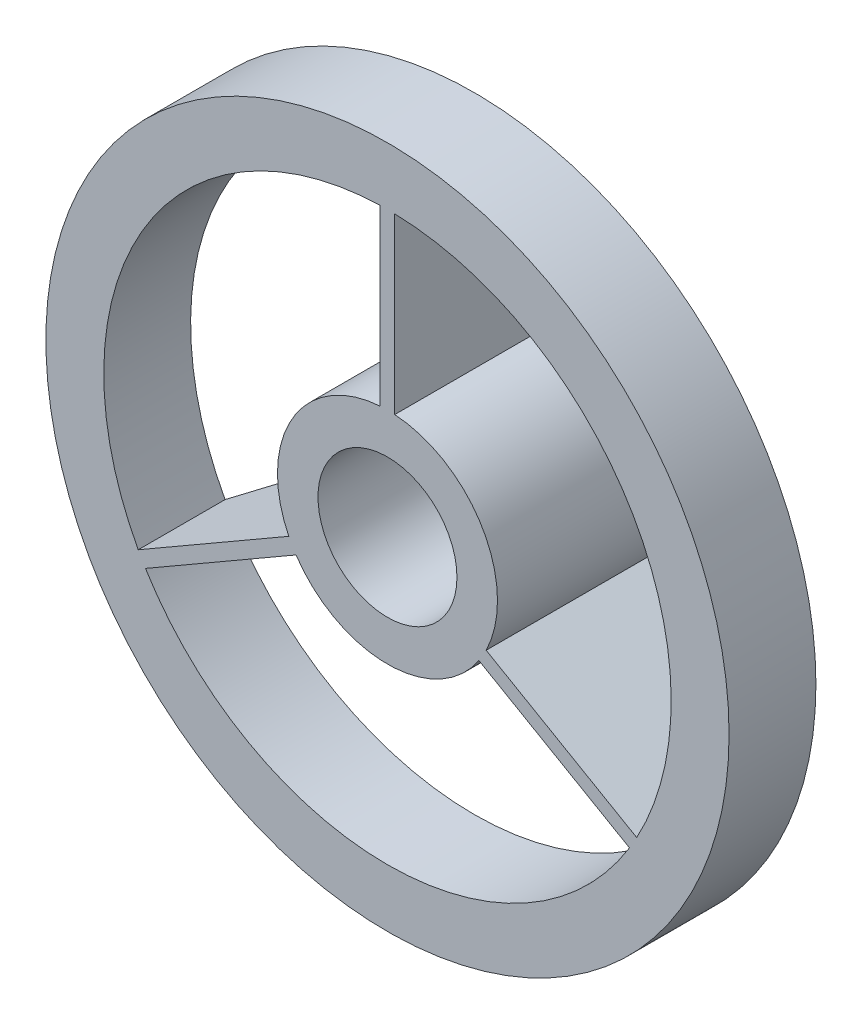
from build123d import *

# Parameters (mm, degrees)
CROQUIS1_R              = 1.9
CROQUIS1_R_2            = 1.2
SALIENTE_EXTRUIR1_DEPTH = 3.5
CROQUIS2_R              = 5.9
CROQUIS2_R_2            = 4.9
SALIENTE_EXTRUIR2_DEPTH = 1.5
SALIENTE_EXTRUIR3_DEPTH = 0.125
MATRIZC1_COUNT          = 3


with BuildPart() as part:
    # Croquis1 → Saliente-Extruir1 (new body)
    with BuildSketch(Plane.XY):
        Circle(CROQUIS1_R)
        Circle(CROQUIS1_R_2, mode=Mode.SUBTRACT)
    extrude(amount=SALIENTE_EXTRUIR1_DEPTH)



with BuildPart() as body_2:
    # Croquis2 → Saliente-Extruir2 (new body)
    with BuildSketch(Plane.XY.offset(3.5)):
        Circle(CROQUIS2_R)
        Circle(CROQUIS2_R_2, mode=Mode.SUBTRACT)
    extrude(amount=-SALIENTE_EXTRUIR2_DEPTH)


with BuildPart() as part_1:
    add(part.part)

    add(body_2.part)  # Saliente-Extruir3 merges body 2
    # Croquis4 → Saliente-Extruir3 (add, symmetric)
    with BuildSketch(Plane(origin=(0, 0, 0), x_dir=(0, 0, -1), z_dir=(1, 0, 0))):
        Polygon((-3.5, 1.9), (-3.5, 4.9), (-2, 4.9), (0, 1.9), (0, 1.7), (-3.5, 1.7), align=None)
    saliente_extruir3 = extrude(amount=SALIENTE_EXTRUIR3_DEPTH, both=True)

    # MatrizC1: Saliente-Extruir3 ×3 about axis
    matrizc1_axis = Axis((0, 0, 0), (0, 0, 1))
    for i in range(1, MATRIZC1_COUNT):
        add(saliente_extruir3.rotate(matrizc1_axis, i * 360 / MATRIZC1_COUNT))


solid = part_1.part
